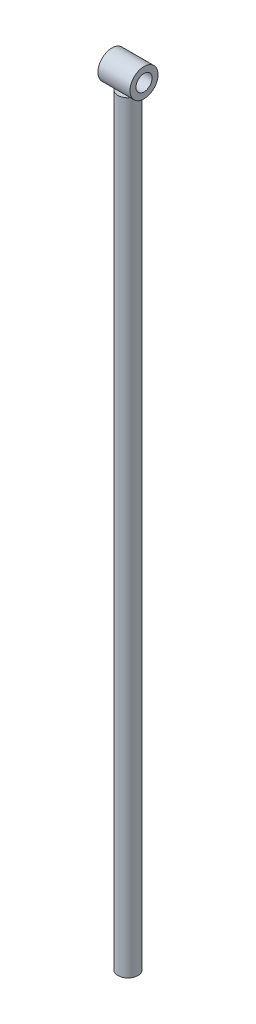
ISO-10303-21;
HEADER;
FILE_DESCRIPTION(('STEP AP214'),'2;1');
FILE_NAME('part.step','',(''),(''),'','','');
FILE_SCHEMA(('AUTOMOTIVE_DESIGN { 1 0 10303 214 1 1 1 1 }'));
ENDSEC;
DATA;
#1=APPLICATION_CONTEXT('core data for automotive mechanical design processes');
#2=APPLICATION_PROTOCOL_DEFINITION('international standard','automotive_design',2000,#1);
#3=PRODUCT_CONTEXT('',#1,'mechanical');
#4=PRODUCT('Part','Part','',(#3));
#5=PRODUCT_RELATED_PRODUCT_CATEGORY('part','',(#4));
#6=PRODUCT_DEFINITION_FORMATION('','',#4);
#7=PRODUCT_DEFINITION_CONTEXT('part definition',#1,'design');
#8=PRODUCT_DEFINITION('design','',#6,#7);
#9=PRODUCT_DEFINITION_SHAPE('','',#8);
#10=(LENGTH_UNIT() NAMED_UNIT(*) SI_UNIT(.MILLI.,.METRE.));
#11=(NAMED_UNIT(*) PLANE_ANGLE_UNIT() SI_UNIT($,.RADIAN.));
#12=(NAMED_UNIT(*) SI_UNIT($,.STERADIAN.) SOLID_ANGLE_UNIT());
#13=UNCERTAINTY_MEASURE_WITH_UNIT(LENGTH_MEASURE(1.E-05),#10,'distance_accuracy_value','');
#14=(GEOMETRIC_REPRESENTATION_CONTEXT(3) GLOBAL_UNCERTAINTY_ASSIGNED_CONTEXT((#13)) GLOBAL_UNIT_ASSIGNED_CONTEXT((#10,
#11,#12)) REPRESENTATION_CONTEXT('',''));
#15=CARTESIAN_POINT('',(0.,0.,0.));
#16=DIRECTION('',(0.,0.,1.));
#17=DIRECTION('',(1.,0.,0.));
#18=AXIS2_PLACEMENT_3D('',#15,#16,#17);
#19=CARTESIAN_POINT('',(20.,967.5,0.));
#20=DIRECTION('',(1.,0.,0.));
#21=DIRECTION('',(0.,0.,-1.));
#22=AXIS2_PLACEMENT_3D('',#19,#20,#21);
#23=PLANE('',#22);
#24=CARTESIAN_POINT('',(20.,967.5,0.));
#25=DIRECTION('',(1.,0.,0.));
#26=DIRECTION('',(0.,0.,-1.));
#27=AXIS2_PLACEMENT_3D('',#24,#25,#26);
#28=CIRCLE('',#27,17.5);
#29=CARTESIAN_POINT('',(20.,967.5,-17.5));
#30=VERTEX_POINT('',#29);
#31=EDGE_CURVE('E11',#30,#30,#28,.T.);
#32=ORIENTED_EDGE('',*,*,#31,.T.);
#33=EDGE_LOOP('',(#32));
#34=FACE_BOUND('',#33,.T.);
#35=CARTESIAN_POINT('',(20.,967.5,0.));
#36=DIRECTION('',(1.,0.,0.));
#37=DIRECTION('',(0.,0.,-1.));
#38=AXIS2_PLACEMENT_3D('',#35,#36,#37);
#39=CIRCLE('',#38,10.);
#40=CARTESIAN_POINT('',(20.,967.5,-10.));
#41=VERTEX_POINT('',#40);
#42=EDGE_CURVE('E49',#41,#41,#39,.T.);
#43=ORIENTED_EDGE('',*,*,#42,.F.);
#44=EDGE_LOOP('',(#43));
#45=FACE_BOUND('',#44,.T.);
#46=ADVANCED_FACE('F38',(#34,#45),#23,.T.);
#47=CARTESIAN_POINT('',(-20.,967.5,0.));
#48=DIRECTION('',(1.,0.,0.));
#49=DIRECTION('',(0.,0.,-1.));
#50=AXIS2_PLACEMENT_3D('',#47,#48,#49);
#51=PLANE('',#50);
#52=CARTESIAN_POINT('',(-20.,967.5,0.));
#53=DIRECTION('',(1.,0.,0.));
#54=DIRECTION('',(0.,0.,-1.));
#55=AXIS2_PLACEMENT_3D('',#52,#53,#54);
#56=CIRCLE('',#55,17.5);
#57=CARTESIAN_POINT('',(-20.,967.5,-17.5));
#58=VERTEX_POINT('',#57);
#59=EDGE_CURVE('E42',#58,#58,#56,.T.);
#60=ORIENTED_EDGE('',*,*,#59,.F.);
#61=EDGE_LOOP('',(#60));
#62=FACE_BOUND('',#61,.T.);
#63=CARTESIAN_POINT('',(-20.,967.5,0.));
#64=DIRECTION('',(1.,0.,0.));
#65=DIRECTION('',(0.,0.,-1.));
#66=AXIS2_PLACEMENT_3D('',#63,#64,#65);
#67=CIRCLE('',#66,10.);
#68=CARTESIAN_POINT('',(-20.,967.5,-10.));
#69=VERTEX_POINT('',#68);
#70=EDGE_CURVE('E51',#69,#69,#67,.T.);
#71=ORIENTED_EDGE('',*,*,#70,.T.);
#72=EDGE_LOOP('',(#71));
#73=FACE_BOUND('',#72,.T.);
#74=ADVANCED_FACE('F61',(#62,#73),#51,.F.);
#75=CARTESIAN_POINT('',(20.,967.5,0.));
#76=DIRECTION('',(-1.,0.,0.));
#77=DIRECTION('',(0.,0.,1.));
#78=AXIS2_PLACEMENT_3D('',#75,#76,#77);
#79=CYLINDRICAL_SURFACE('',#78,17.5);
#80=ORIENTED_EDGE('',*,*,#31,.F.);
#81=EDGE_LOOP('',(#80));
#82=FACE_BOUND('',#81,.T.);
#83=ORIENTED_EDGE('',*,*,#59,.T.);
#84=EDGE_LOOP('',(#83));
#85=FACE_BOUND('',#84,.T.);
#86=ADVANCED_FACE('F40',(#82,#85),#79,.T.);
#87=CARTESIAN_POINT('',(20.,967.5,0.));
#88=DIRECTION('',(-1.,0.,0.));
#89=DIRECTION('',(0.,0.,1.));
#90=AXIS2_PLACEMENT_3D('',#87,#88,#89);
#91=CYLINDRICAL_SURFACE('',#90,10.);
#92=ORIENTED_EDGE('',*,*,#42,.T.);
#93=EDGE_LOOP('',(#92));
#94=FACE_BOUND('',#93,.T.);
#95=ORIENTED_EDGE('',*,*,#70,.F.);
#96=EDGE_LOOP('',(#95));
#97=FACE_BOUND('',#96,.T.);
#98=ADVANCED_FACE('F57',(#94,#97),#91,.F.);
#99=CLOSED_SHELL('',(#46,#74,#86,#98));
#100=MANIFOLD_SOLID_BREP('B2',#99);
#101=CARTESIAN_POINT('',(0.,950.,0.));
#102=DIRECTION('',(0.,-1.,0.));
#103=DIRECTION('',(0.,0.,-1.));
#104=AXIS2_PLACEMENT_3D('',#101,#102,#103);
#105=CYLINDRICAL_SURFACE('',#104,12.5);
#106=CARTESIAN_POINT('',(0.,950.,0.));
#107=DIRECTION('',(0.,1.,0.));
#108=DIRECTION('',(0.,0.,1.));
#109=AXIS2_PLACEMENT_3D('',#106,#107,#108);
#110=CIRCLE('',#109,12.5);
#111=CARTESIAN_POINT('',(0.,950.,-12.5));
#112=VERTEX_POINT('',#111);
#113=EDGE_CURVE('E37',#112,#112,#110,.T.);
#114=CARTESIAN_POINT('',(0.,0.,0.));
#115=DIRECTION('',(0.,1.,0.));
#116=DIRECTION('',(0.,0.,1.));
#117=AXIS2_PLACEMENT_3D('',#114,#115,#116);
#118=CIRCLE('',#117,12.5);
#119=CARTESIAN_POINT('',(0.,-1.11022302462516E-13,-12.5));
#120=VERTEX_POINT('',#119);
#121=EDGE_CURVE('E102',#120,#120,#118,.T.);
#122=CARTESIAN_POINT('',(0.,950.,-12.5));
#123=CARTESIAN_POINT('',(0.,940.104166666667,-12.5));
#124=CARTESIAN_POINT('',(0.,930.208333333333,-12.5));
#125=CARTESIAN_POINT('',(0.,910.416666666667,-12.5));
#126=CARTESIAN_POINT('',(0.,900.520833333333,-12.5));
#127=CARTESIAN_POINT('',(0.,880.729166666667,-12.5));
#128=CARTESIAN_POINT('',(0.,870.833333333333,-12.5));
#129=CARTESIAN_POINT('',(0.,851.041666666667,-12.5));
#130=CARTESIAN_POINT('',(0.,841.145833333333,-12.5));
#131=CARTESIAN_POINT('',(0.,821.354166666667,-12.5));
#132=CARTESIAN_POINT('',(0.,811.458333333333,-12.5));
#133=CARTESIAN_POINT('',(0.,791.666666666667,-12.5));
#134=CARTESIAN_POINT('',(0.,781.770833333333,-12.5));
#135=CARTESIAN_POINT('',(0.,761.979166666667,-12.5));
#136=CARTESIAN_POINT('',(0.,752.083333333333,-12.5));
#137=CARTESIAN_POINT('',(0.,732.291666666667,-12.5));
#138=CARTESIAN_POINT('',(0.,722.395833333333,-12.5));
#139=CARTESIAN_POINT('',(0.,702.604166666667,-12.5));
#140=CARTESIAN_POINT('',(0.,692.708333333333,-12.5));
#141=CARTESIAN_POINT('',(0.,672.916666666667,-12.5));
#142=CARTESIAN_POINT('',(0.,663.020833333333,-12.5));
#143=CARTESIAN_POINT('',(0.,643.229166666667,-12.5));
#144=CARTESIAN_POINT('',(0.,633.333333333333,-12.5));
#145=CARTESIAN_POINT('',(0.,613.541666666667,-12.5));
#146=CARTESIAN_POINT('',(0.,603.645833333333,-12.5));
#147=CARTESIAN_POINT('',(0.,583.854166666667,-12.5));
#148=CARTESIAN_POINT('',(0.,573.958333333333,-12.5));
#149=CARTESIAN_POINT('',(0.,554.166666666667,-12.5));
#150=CARTESIAN_POINT('',(0.,544.270833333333,-12.5));
#151=CARTESIAN_POINT('',(0.,524.479166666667,-12.5));
#152=CARTESIAN_POINT('',(0.,514.583333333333,-12.5));
#153=CARTESIAN_POINT('',(0.,494.791666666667,-12.5));
#154=CARTESIAN_POINT('',(0.,484.895833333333,-12.5));
#155=CARTESIAN_POINT('',(0.,465.104166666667,-12.5));
#156=CARTESIAN_POINT('',(0.,455.208333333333,-12.5));
#157=CARTESIAN_POINT('',(0.,435.416666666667,-12.5));
#158=CARTESIAN_POINT('',(0.,425.520833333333,-12.5));
#159=CARTESIAN_POINT('',(0.,405.729166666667,-12.5));
#160=CARTESIAN_POINT('',(0.,395.833333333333,-12.5));
#161=CARTESIAN_POINT('',(0.,376.041666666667,-12.5));
#162=CARTESIAN_POINT('',(0.,366.145833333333,-12.5));
#163=CARTESIAN_POINT('',(0.,346.354166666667,-12.5));
#164=CARTESIAN_POINT('',(0.,336.458333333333,-12.5));
#165=CARTESIAN_POINT('',(0.,316.666666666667,-12.5));
#166=CARTESIAN_POINT('',(0.,306.770833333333,-12.5));
#167=CARTESIAN_POINT('',(0.,286.979166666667,-12.5));
#168=CARTESIAN_POINT('',(0.,277.083333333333,-12.5));
#169=CARTESIAN_POINT('',(0.,257.291666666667,-12.5));
#170=CARTESIAN_POINT('',(0.,247.395833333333,-12.5));
#171=CARTESIAN_POINT('',(0.,227.604166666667,-12.5));
#172=CARTESIAN_POINT('',(0.,217.708333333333,-12.5));
#173=CARTESIAN_POINT('',(0.,197.916666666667,-12.5));
#174=CARTESIAN_POINT('',(0.,188.020833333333,-12.5));
#175=CARTESIAN_POINT('',(0.,168.229166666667,-12.5));
#176=CARTESIAN_POINT('',(0.,158.333333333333,-12.5));
#177=CARTESIAN_POINT('',(0.,138.541666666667,-12.5));
#178=CARTESIAN_POINT('',(0.,128.645833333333,-12.5));
#179=CARTESIAN_POINT('',(0.,108.854166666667,-12.5));
#180=CARTESIAN_POINT('',(0.,98.9583333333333,-12.5));
#181=CARTESIAN_POINT('',(0.,79.1666666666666,-12.5));
#182=CARTESIAN_POINT('',(0.,69.2708333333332,-12.5));
#183=CARTESIAN_POINT('',(0.,49.4791666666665,-12.5));
#184=CARTESIAN_POINT('',(0.,39.5833333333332,-12.5));
#185=CARTESIAN_POINT('',(0.,19.7916666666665,-12.5));
#186=CARTESIAN_POINT('',(0.,9.89583333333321,-12.5));
#187=CARTESIAN_POINT('',(0.,-1.11022302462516E-13,-12.5));
#188=B_SPLINE_CURVE_WITH_KNOTS('',3,(#122,#123,#124,#125,#126,#127,#128,#129,#130,#131,#132,
#133,#134,#135,#136,#137,#138,#139,#140,#141,#142,#143,#144,#145,#146,#147,#148,#149,#150,#151,
#152,#153,#154,#155,#156,#157,#158,#159,#160,#161,#162,#163,#164,#165,#166,#167,#168,#169,#170,
#171,#172,#173,#174,#175,#176,#177,#178,#179,#180,#181,#182,#183,#184,#185,#186,#187),
.UNSPECIFIED.,.F.,.F.,(4,2,2,2,2,2,2,2,2,2,2,2,2,2,2,2,2,2,2,2,2,2,2,2,2,2,2,2,2,2,2,2,4),(0.,
29.6875000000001,59.3750000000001,89.0625,118.75,148.4375,178.125,207.8125,237.5,267.1875,
296.875,326.5625,356.25,385.9375,415.625,445.3125,475.,504.6875,534.375,564.0625,593.75,
623.4375,653.125,682.8125,712.5,742.1875,771.875,801.5625,831.25,860.9375,890.625,920.3125,
950.),.UNSPECIFIED.);
#189=EDGE_CURVE('BSEAM99',#112,#120,#188,.T.);
#190=ORIENTED_EDGE('',*,*,#113,.F.);
#191=ORIENTED_EDGE('',*,*,#121,.T.);
#192=ORIENTED_EDGE('',*,*,#189,.T.);
#193=ORIENTED_EDGE('',*,*,#189,.F.);
#194=EDGE_LOOP('',(#190,#192,#191,#193));
#195=FACE_BOUND('',#194,.T.);
#196=ADVANCED_FACE('F99',(#195),#105,.T.);
#197=CARTESIAN_POINT('',(0.,950.,0.));
#198=DIRECTION('',(0.,1.,0.));
#199=DIRECTION('',(0.,0.,1.));
#200=AXIS2_PLACEMENT_3D('',#197,#198,#199);
#201=PLANE('',#200);
#202=ORIENTED_EDGE('',*,*,#113,.T.);
#203=EDGE_LOOP('',(#202));
#204=FACE_BOUND('',#203,.T.);
#205=ADVANCED_FACE('F114',(#204),#201,.T.);
#206=CARTESIAN_POINT('',(0.,0.,0.));
#207=DIRECTION('',(0.,1.,0.));
#208=DIRECTION('',(0.,0.,1.));
#209=AXIS2_PLACEMENT_3D('',#206,#207,#208);
#210=PLANE('',#209);
#211=ORIENTED_EDGE('',*,*,#121,.F.);
#212=EDGE_LOOP('',(#211));
#213=FACE_BOUND('',#212,.T.);
#214=ADVANCED_FACE('F112',(#213),#210,.F.);
#215=CLOSED_SHELL('',(#196,#205,#214));
#216=MANIFOLD_SOLID_BREP('B6',#215);
#217=ADVANCED_BREP_SHAPE_REPRESENTATION('',(#18,#100,#216),#14);
#218=SHAPE_DEFINITION_REPRESENTATION(#9,#217);
ENDSEC;
END-ISO-10303-21;
